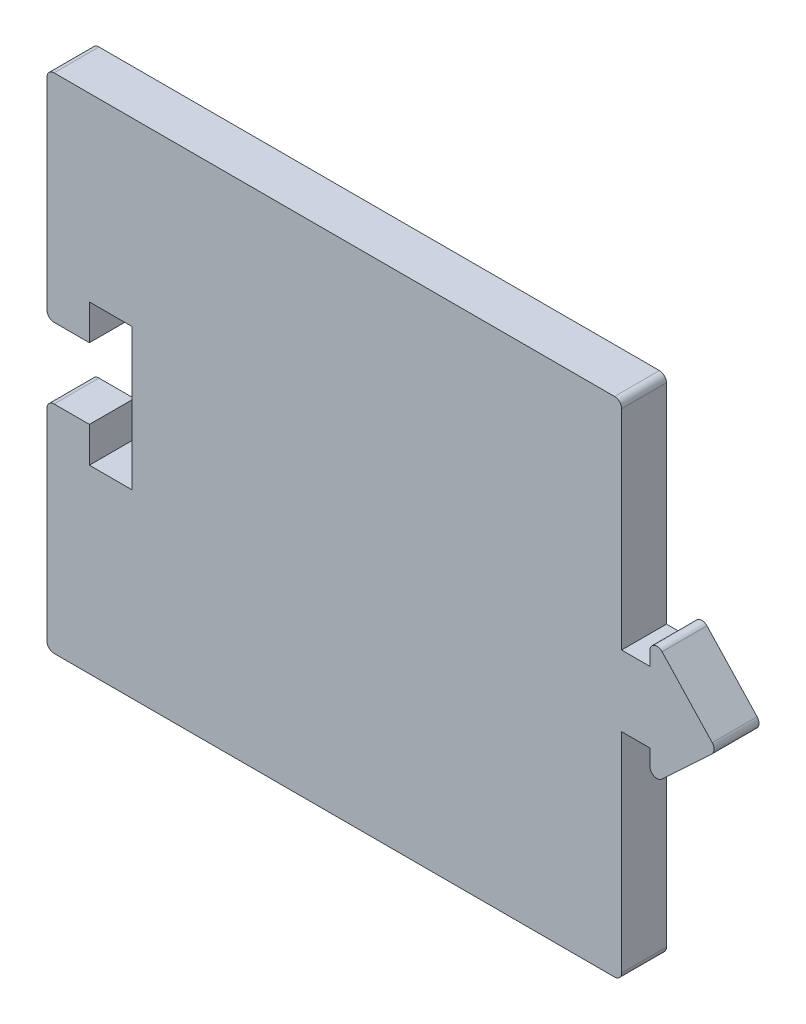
ISO-10303-21;
HEADER;
FILE_DESCRIPTION(('STEP AP214'),'2;1');
FILE_NAME('part.step','',(''),(''),'','','');
FILE_SCHEMA(('AUTOMOTIVE_DESIGN { 1 0 10303 214 1 1 1 1 }'));
ENDSEC;
DATA;
#1=APPLICATION_CONTEXT('core data for automotive mechanical design processes');
#2=APPLICATION_PROTOCOL_DEFINITION('international standard','automotive_design',2000,#1);
#3=PRODUCT_CONTEXT('',#1,'mechanical');
#4=PRODUCT('Part','Part','',(#3));
#5=PRODUCT_RELATED_PRODUCT_CATEGORY('part','',(#4));
#6=PRODUCT_DEFINITION_FORMATION('','',#4);
#7=PRODUCT_DEFINITION_CONTEXT('part definition',#1,'design');
#8=PRODUCT_DEFINITION('design','',#6,#7);
#9=PRODUCT_DEFINITION_SHAPE('','',#8);
#10=(LENGTH_UNIT() NAMED_UNIT(*) SI_UNIT(.MILLI.,.METRE.));
#11=(NAMED_UNIT(*) PLANE_ANGLE_UNIT() SI_UNIT($,.RADIAN.));
#12=(NAMED_UNIT(*) SI_UNIT($,.STERADIAN.) SOLID_ANGLE_UNIT());
#13=UNCERTAINTY_MEASURE_WITH_UNIT(LENGTH_MEASURE(1.E-05),#10,'distance_accuracy_value','');
#14=(GEOMETRIC_REPRESENTATION_CONTEXT(3) GLOBAL_UNCERTAINTY_ASSIGNED_CONTEXT((#13)) GLOBAL_UNIT_ASSIGNED_CONTEXT((#10,
#11,#12)) REPRESENTATION_CONTEXT('',''));
#15=CARTESIAN_POINT('',(0.,0.,0.));
#16=DIRECTION('',(0.,0.,1.));
#17=DIRECTION('',(1.,0.,0.));
#18=AXIS2_PLACEMENT_3D('',#15,#16,#17);
#19=CARTESIAN_POINT('',(0.,15.28,3.175));
#20=DIRECTION('',(1.,0.,0.));
#21=DIRECTION('',(0.,0.,-1.));
#22=AXIS2_PLACEMENT_3D('',#19,#20,#21);
#23=PLANE('',#22);
#24=DIRECTION('',(0.,-1.,0.));
#25=VECTOR('',#24,1.);
#26=CARTESIAN_POINT('',(0.,15.28,0.));
#27=LINE('',#26,#25);
#28=CARTESIAN_POINT('',(0.,14.78,0.));
#29=VERTEX_POINT('',#28);
#30=CARTESIAN_POINT('',(0.,0.5,0.));
#31=VERTEX_POINT('',#30);
#32=EDGE_CURVE('E284',#29,#31,#27,.T.);
#33=ORIENTED_EDGE('',*,*,#32,.T.);
#34=DIRECTION('',(0.,0.,-1.));
#35=VECTOR('',#34,1.);
#36=CARTESIAN_POINT('',(0.,0.5,3.175));
#37=LINE('',#36,#35);
#38=CARTESIAN_POINT('',(0.,0.5,3.175));
#39=VERTEX_POINT('',#38);
#40=EDGE_CURVE('E412',#31,#39,#37,.F.);
#41=ORIENTED_EDGE('',*,*,#40,.T.);
#42=DIRECTION('',(0.,-1.,0.));
#43=VECTOR('',#42,1.);
#44=CARTESIAN_POINT('',(0.,15.28,3.175));
#45=LINE('',#44,#43);
#46=CARTESIAN_POINT('',(0.,14.78,3.175));
#47=VERTEX_POINT('',#46);
#48=EDGE_CURVE('E329',#47,#39,#45,.T.);
#49=ORIENTED_EDGE('',*,*,#48,.F.);
#50=DIRECTION('',(0.,0.,-1.));
#51=VECTOR('',#50,1.);
#52=CARTESIAN_POINT('',(0.,14.78,3.175));
#53=LINE('',#52,#51);
#54=EDGE_CURVE('E409',#47,#29,#53,.T.);
#55=ORIENTED_EDGE('',*,*,#54,.T.);
#56=EDGE_LOOP('',(#33,#41,#49,#55));
#57=FACE_BOUND('',#56,.T.);
#58=ADVANCED_FACE('F33',(#57),#23,.F.);
#59=CARTESIAN_POINT('',(0.,0.,3.175));
#60=DIRECTION('',(0.,1.,0.));
#61=DIRECTION('',(-1.,0.,0.));
#62=AXIS2_PLACEMENT_3D('',#59,#60,#61);
#63=PLANE('',#62);
#64=DIRECTION('',(1.,0.,0.));
#65=VECTOR('',#64,1.);
#66=CARTESIAN_POINT('',(0.,0.,0.));
#67=LINE('',#66,#65);
#68=CARTESIAN_POINT('',(0.5,0.,0.));
#69=VERTEX_POINT('',#68);
#70=CARTESIAN_POINT('',(40.14,0.,0.));
#71=VERTEX_POINT('',#70);
#72=EDGE_CURVE('E287',#69,#71,#67,.T.);
#73=ORIENTED_EDGE('',*,*,#72,.T.);
#74=DIRECTION('',(0.,0.,-1.));
#75=VECTOR('',#74,1.);
#76=CARTESIAN_POINT('',(40.14,0.,3.175));
#77=LINE('',#76,#75);
#78=CARTESIAN_POINT('',(40.14,0.,3.175));
#79=VERTEX_POINT('',#78);
#80=EDGE_CURVE('E407',#71,#79,#77,.F.);
#81=ORIENTED_EDGE('',*,*,#80,.T.);
#82=DIRECTION('',(1.,0.,0.));
#83=VECTOR('',#82,1.);
#84=CARTESIAN_POINT('',(0.,0.,3.175));
#85=LINE('',#84,#83);
#86=CARTESIAN_POINT('',(0.5,0.,3.175));
#87=VERTEX_POINT('',#86);
#88=EDGE_CURVE('E231',#87,#79,#85,.T.);
#89=ORIENTED_EDGE('',*,*,#88,.F.);
#90=DIRECTION('',(0.,0.,-1.));
#91=VECTOR('',#90,1.);
#92=CARTESIAN_POINT('',(0.5,0.,3.175));
#93=LINE('',#92,#91);
#94=EDGE_CURVE('E404',#87,#69,#93,.T.);
#95=ORIENTED_EDGE('',*,*,#94,.T.);
#96=EDGE_LOOP('',(#73,#81,#89,#95));
#97=FACE_BOUND('',#96,.T.);
#98=ADVANCED_FACE('F494',(#97),#63,.F.);
#99=CARTESIAN_POINT('',(40.64,15.28,3.175));
#100=DIRECTION('',(-1.,0.,0.));
#101=DIRECTION('',(0.,0.,1.));
#102=AXIS2_PLACEMENT_3D('',#99,#100,#101);
#103=PLANE('',#102);
#104=DIRECTION('',(0.,1.,0.));
#105=VECTOR('',#104,1.);
#106=CARTESIAN_POINT('',(40.64,15.28,3.175));
#107=LINE('',#106,#105);
#108=CARTESIAN_POINT('',(40.64,0.499999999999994,3.175));
#109=VERTEX_POINT('',#108);
#110=CARTESIAN_POINT('',(40.64,15.28,3.175));
#111=VERTEX_POINT('',#110);
#112=EDGE_CURVE('E218',#109,#111,#107,.T.);
#113=ORIENTED_EDGE('',*,*,#112,.F.);
#114=DIRECTION('',(0.,0.,-1.));
#115=VECTOR('',#114,1.);
#116=CARTESIAN_POINT('',(40.64,0.499999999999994,3.175));
#117=LINE('',#116,#115);
#118=CARTESIAN_POINT('',(40.64,0.499999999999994,0.));
#119=VERTEX_POINT('',#118);
#120=EDGE_CURVE('E402',#109,#119,#117,.T.);
#121=ORIENTED_EDGE('',*,*,#120,.T.);
#122=DIRECTION('',(0.,1.,0.));
#123=VECTOR('',#122,1.);
#124=CARTESIAN_POINT('',(40.64,15.28,0.));
#125=LINE('',#124,#123);
#126=CARTESIAN_POINT('',(40.64,15.28,0.));
#127=VERTEX_POINT('',#126);
#128=EDGE_CURVE('E237',#119,#127,#125,.T.);
#129=ORIENTED_EDGE('',*,*,#128,.T.);
#130=DIRECTION('',(0.,0.,-1.));
#131=VECTOR('',#130,1.);
#132=CARTESIAN_POINT('',(40.64,15.28,3.175));
#133=LINE('',#132,#131);
#134=EDGE_CURVE('E234',#111,#127,#133,.T.);
#135=ORIENTED_EDGE('',*,*,#134,.F.);
#136=EDGE_LOOP('',(#113,#121,#129,#135));
#137=FACE_BOUND('',#136,.T.);
#138=ADVANCED_FACE('F235',(#137),#103,.F.);
#139=CARTESIAN_POINT('',(42.64,15.28,3.175));
#140=DIRECTION('',(0.,1.,0.));
#141=DIRECTION('',(0.,0.,1.));
#142=AXIS2_PLACEMENT_3D('',#139,#140,#141);
#143=PLANE('',#142);
#144=DIRECTION('',(1.,0.,0.));
#145=VECTOR('',#144,1.);
#146=CARTESIAN_POINT('',(42.64,15.28,0.));
#147=LINE('',#146,#145);
#148=CARTESIAN_POINT('',(42.64,15.28,0.));
#149=VERTEX_POINT('',#148);
#150=EDGE_CURVE('E291',#127,#149,#147,.T.);
#151=ORIENTED_EDGE('',*,*,#150,.T.);
#152=DIRECTION('',(0.,0.,-1.));
#153=VECTOR('',#152,1.);
#154=CARTESIAN_POINT('',(42.64,15.28,3.175));
#155=LINE('',#154,#153);
#156=CARTESIAN_POINT('',(42.64,15.28,3.175));
#157=VERTEX_POINT('',#156);
#158=EDGE_CURVE('E241',#157,#149,#155,.T.);
#159=ORIENTED_EDGE('',*,*,#158,.F.);
#160=DIRECTION('',(1.,0.,0.));
#161=VECTOR('',#160,1.);
#162=CARTESIAN_POINT('',(42.64,15.28,3.175));
#163=LINE('',#162,#161);
#164=EDGE_CURVE('E223',#111,#157,#163,.T.);
#165=ORIENTED_EDGE('',*,*,#164,.F.);
#166=ORIENTED_EDGE('',*,*,#134,.T.);
#167=EDGE_LOOP('',(#151,#159,#165,#166));
#168=FACE_BOUND('',#167,.T.);
#169=ADVANCED_FACE('F243',(#168),#143,.F.);
#170=CARTESIAN_POINT('',(42.64,13.0079287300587,3.175));
#171=DIRECTION('',(1.,0.,0.));
#172=DIRECTION('',(0.,1.,0.));
#173=AXIS2_PLACEMENT_3D('',#170,#171,#172);
#174=PLANE('',#173);
#175=DIRECTION('',(0.,-1.,0.));
#176=VECTOR('',#175,1.);
#177=CARTESIAN_POINT('',(42.64,13.0079287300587,0.));
#178=LINE('',#177,#176);
#179=CARTESIAN_POINT('',(42.64,14.1591981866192,0.));
#180=VERTEX_POINT('',#179);
#181=EDGE_CURVE('E293',#149,#180,#178,.T.);
#182=ORIENTED_EDGE('',*,*,#181,.T.);
#183=DIRECTION('',(0.,0.,-1.));
#184=VECTOR('',#183,1.);
#185=CARTESIAN_POINT('',(42.64,14.1591981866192,3.175));
#186=LINE('',#185,#184);
#187=CARTESIAN_POINT('',(42.64,14.1591981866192,3.175));
#188=VERTEX_POINT('',#187);
#189=EDGE_CURVE('E376',#180,#188,#186,.F.);
#190=ORIENTED_EDGE('',*,*,#189,.T.);
#191=DIRECTION('',(0.,-1.,0.));
#192=VECTOR('',#191,1.);
#193=CARTESIAN_POINT('',(42.64,13.0079287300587,3.175));
#194=LINE('',#193,#192);
#195=EDGE_CURVE('E246',#157,#188,#194,.T.);
#196=ORIENTED_EDGE('',*,*,#195,.F.);
#197=ORIENTED_EDGE('',*,*,#158,.T.);
#198=EDGE_LOOP('',(#182,#190,#196,#197));
#199=FACE_BOUND('',#198,.T.);
#200=ADVANCED_FACE('F501',(#199),#174,.F.);
#201=CARTESIAN_POINT('',(47.39,17.4449885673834,3.175));
#202=DIRECTION('',(-0.682624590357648,0.73076923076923,0.));
#203=DIRECTION('',(-0.73076923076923,-0.682624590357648,0.));
#204=AXIS2_PLACEMENT_3D('',#201,#202,#203);
#205=PLANE('',#204);
#206=DIRECTION('',(0.73076923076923,0.682624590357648,0.));
#207=VECTOR('',#206,1.);
#208=CARTESIAN_POINT('',(47.39,17.4449885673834,3.175));
#209=LINE('',#208,#207);
#210=CARTESIAN_POINT('',(43.4813122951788,13.7938135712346,3.175));
#211=VERTEX_POINT('',#210);
#212=CARTESIAN_POINT('',(47.0246153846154,17.1036762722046,3.175));
#213=VERTEX_POINT('',#212);
#214=EDGE_CURVE('E248',#211,#213,#209,.T.);
#215=ORIENTED_EDGE('',*,*,#214,.F.);
#216=DIRECTION('',(0.,0.,-1.));
#217=VECTOR('',#216,1.);
#218=CARTESIAN_POINT('',(43.4813122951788,13.7938135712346,3.175));
#219=LINE('',#218,#217);
#220=CARTESIAN_POINT('',(43.4813122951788,13.7938135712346,0.));
#221=VERTEX_POINT('',#220);
#222=EDGE_CURVE('E355',#211,#221,#219,.T.);
#223=ORIENTED_EDGE('',*,*,#222,.T.);
#224=DIRECTION('',(0.73076923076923,0.682624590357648,0.));
#225=VECTOR('',#224,1.);
#226=CARTESIAN_POINT('',(47.39,17.4449885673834,0.));
#227=LINE('',#226,#225);
#228=CARTESIAN_POINT('',(47.0246153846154,17.1036762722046,0.));
#229=VERTEX_POINT('',#228);
#230=EDGE_CURVE('E296',#221,#229,#227,.T.);
#231=ORIENTED_EDGE('',*,*,#230,.T.);
#232=DIRECTION('',(0.,0.,-1.));
#233=VECTOR('',#232,1.);
#234=CARTESIAN_POINT('',(47.0246153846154,17.1036762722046,3.175));
#235=LINE('',#234,#233);
#236=EDGE_CURVE('E240',#229,#213,#235,.F.);
#237=ORIENTED_EDGE('',*,*,#236,.T.);
#238=EDGE_LOOP('',(#215,#223,#231,#237));
#239=FACE_BOUND('',#238,.T.);
#240=ADVANCED_FACE('F509',(#239),#205,.F.);
#241=CARTESIAN_POINT('',(42.64,22.53,3.175));
#242=DIRECTION('',(-0.730769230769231,-0.682624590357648,0.));
#243=DIRECTION('',(0.682624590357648,-0.730769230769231,0.));
#244=AXIS2_PLACEMENT_3D('',#241,#242,#243);
#245=PLANE('',#244);
#246=DIRECTION('',(-0.682624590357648,0.730769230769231,0.));
#247=VECTOR('',#246,1.);
#248=CARTESIAN_POINT('',(42.64,22.53,3.175));
#249=LINE('',#248,#247);
#250=CARTESIAN_POINT('',(47.0486877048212,17.810373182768,3.175));
#251=VERTEX_POINT('',#250);
#252=CARTESIAN_POINT('',(43.5053846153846,21.603580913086,3.175));
#253=VERTEX_POINT('',#252);
#254=EDGE_CURVE('E254',#251,#253,#249,.T.);
#255=ORIENTED_EDGE('',*,*,#254,.F.);
#256=DIRECTION('',(0.,0.,-1.));
#257=VECTOR('',#256,1.);
#258=CARTESIAN_POINT('',(47.0486877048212,17.810373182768,3.175));
#259=LINE('',#258,#257);
#260=CARTESIAN_POINT('',(47.0486877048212,17.810373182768,0.));
#261=VERTEX_POINT('',#260);
#262=EDGE_CURVE('E396',#251,#261,#259,.T.);
#263=ORIENTED_EDGE('',*,*,#262,.T.);
#264=DIRECTION('',(-0.682624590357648,0.730769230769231,0.));
#265=VECTOR('',#264,1.);
#266=CARTESIAN_POINT('',(42.64,22.53,0.));
#267=LINE('',#266,#265);
#268=CARTESIAN_POINT('',(43.5053846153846,21.603580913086,0.));
#269=VERTEX_POINT('',#268);
#270=EDGE_CURVE('E299',#261,#269,#267,.T.);
#271=ORIENTED_EDGE('',*,*,#270,.T.);
#272=DIRECTION('',(0.,0.,-1.));
#273=VECTOR('',#272,1.);
#274=CARTESIAN_POINT('',(43.5053846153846,21.603580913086,3.175));
#275=LINE('',#274,#273);
#276=EDGE_CURVE('E394',#269,#253,#275,.F.);
#277=ORIENTED_EDGE('',*,*,#276,.T.);
#278=EDGE_LOOP('',(#255,#263,#271,#277));
#279=FACE_BOUND('',#278,.T.);
#280=ADVANCED_FACE('F518',(#279),#245,.F.);
#281=CARTESIAN_POINT('',(42.64,20.28,3.175));
#282=DIRECTION('',(1.,0.,0.));
#283=DIRECTION('',(0.,1.,0.));
#284=AXIS2_PLACEMENT_3D('',#281,#282,#283);
#285=PLANE('',#284);
#286=DIRECTION('',(0.,-1.,0.));
#287=VECTOR('',#286,1.);
#288=CARTESIAN_POINT('',(42.64,20.28,3.175));
#289=LINE('',#288,#287);
#290=CARTESIAN_POINT('',(42.64,21.2622686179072,3.175));
#291=VERTEX_POINT('',#290);
#292=CARTESIAN_POINT('',(42.64,20.28,3.175));
#293=VERTEX_POINT('',#292);
#294=EDGE_CURVE('E257',#291,#293,#289,.T.);
#295=ORIENTED_EDGE('',*,*,#294,.F.);
#296=DIRECTION('',(0.,0.,-1.));
#297=VECTOR('',#296,1.);
#298=CARTESIAN_POINT('',(42.64,21.2622686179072,3.175));
#299=LINE('',#298,#297);
#300=CARTESIAN_POINT('',(42.64,21.2622686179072,0.));
#301=VERTEX_POINT('',#300);
#302=EDGE_CURVE('E399',#291,#301,#299,.T.);
#303=ORIENTED_EDGE('',*,*,#302,.T.);
#304=DIRECTION('',(0.,-1.,0.));
#305=VECTOR('',#304,1.);
#306=CARTESIAN_POINT('',(42.64,20.28,0.));
#307=LINE('',#306,#305);
#308=CARTESIAN_POINT('',(42.64,20.28,0.));
#309=VERTEX_POINT('',#308);
#310=EDGE_CURVE('E302',#301,#309,#307,.T.);
#311=ORIENTED_EDGE('',*,*,#310,.T.);
#312=DIRECTION('',(0.,0.,-1.));
#313=VECTOR('',#312,1.);
#314=CARTESIAN_POINT('',(42.64,20.28,3.175));
#315=LINE('',#314,#313);
#316=EDGE_CURVE('E350',#293,#309,#315,.T.);
#317=ORIENTED_EDGE('',*,*,#316,.F.);
#318=EDGE_LOOP('',(#295,#303,#311,#317));
#319=FACE_BOUND('',#318,.T.);
#320=ADVANCED_FACE('F527',(#319),#285,.F.);
#321=CARTESIAN_POINT('',(40.64,20.28,3.175));
#322=DIRECTION('',(0.,-1.,0.));
#323=DIRECTION('',(0.,0.,-1.));
#324=AXIS2_PLACEMENT_3D('',#321,#322,#323);
#325=PLANE('',#324);
#326=DIRECTION('',(-1.,0.,0.));
#327=VECTOR('',#326,1.);
#328=CARTESIAN_POINT('',(40.64,20.28,0.));
#329=LINE('',#328,#327);
#330=CARTESIAN_POINT('',(40.64,20.28,0.));
#331=VERTEX_POINT('',#330);
#332=EDGE_CURVE('E304',#309,#331,#329,.T.);
#333=ORIENTED_EDGE('',*,*,#332,.T.);
#334=DIRECTION('',(0.,0.,-1.));
#335=VECTOR('',#334,1.);
#336=CARTESIAN_POINT('',(40.64,20.28,3.175));
#337=LINE('',#336,#335);
#338=CARTESIAN_POINT('',(40.64,20.28,3.175));
#339=VERTEX_POINT('',#338);
#340=EDGE_CURVE('E347',#339,#331,#337,.T.);
#341=ORIENTED_EDGE('',*,*,#340,.F.);
#342=DIRECTION('',(-1.,0.,0.));
#343=VECTOR('',#342,1.);
#344=CARTESIAN_POINT('',(40.64,20.28,3.175));
#345=LINE('',#344,#343);
#346=EDGE_CURVE('E259',#293,#339,#345,.T.);
#347=ORIENTED_EDGE('',*,*,#346,.F.);
#348=ORIENTED_EDGE('',*,*,#316,.T.);
#349=EDGE_LOOP('',(#333,#341,#347,#348));
#350=FACE_BOUND('',#349,.T.);
#351=ADVANCED_FACE('F532',(#350),#325,.F.);
#352=CARTESIAN_POINT('',(40.64,35.56,3.175));
#353=DIRECTION('',(-1.,0.,0.));
#354=DIRECTION('',(0.,-1.,0.));
#355=AXIS2_PLACEMENT_3D('',#352,#353,#354);
#356=PLANE('',#355);
#357=DIRECTION('',(0.,1.,0.));
#358=VECTOR('',#357,1.);
#359=CARTESIAN_POINT('',(40.64,35.56,0.));
#360=LINE('',#359,#358);
#361=CARTESIAN_POINT('',(40.64,35.06,0.));
#362=VERTEX_POINT('',#361);
#363=EDGE_CURVE('E306',#331,#362,#360,.T.);
#364=ORIENTED_EDGE('',*,*,#363,.T.);
#365=DIRECTION('',(0.,0.,-1.));
#366=VECTOR('',#365,1.);
#367=CARTESIAN_POINT('',(40.64,35.06,3.175));
#368=LINE('',#367,#366);
#369=CARTESIAN_POINT('',(40.64,35.06,3.175));
#370=VERTEX_POINT('',#369);
#371=EDGE_CURVE('E11',#362,#370,#368,.F.);
#372=ORIENTED_EDGE('',*,*,#371,.T.);
#373=DIRECTION('',(0.,1.,0.));
#374=VECTOR('',#373,1.);
#375=CARTESIAN_POINT('',(40.64,35.56,3.175));
#376=LINE('',#375,#374);
#377=EDGE_CURVE('E261',#339,#370,#376,.T.);
#378=ORIENTED_EDGE('',*,*,#377,.F.);
#379=ORIENTED_EDGE('',*,*,#340,.T.);
#380=EDGE_LOOP('',(#364,#372,#378,#379));
#381=FACE_BOUND('',#380,.T.);
#382=ADVANCED_FACE('F536',(#381),#356,.F.);
#383=CARTESIAN_POINT('',(0.,35.56,3.175));
#384=DIRECTION('',(0.,-1.,0.));
#385=DIRECTION('',(1.,0.,0.));
#386=AXIS2_PLACEMENT_3D('',#383,#384,#385);
#387=PLANE('',#386);
#388=DIRECTION('',(-1.,0.,0.));
#389=VECTOR('',#388,1.);
#390=CARTESIAN_POINT('',(0.,35.56,3.175));
#391=LINE('',#390,#389);
#392=CARTESIAN_POINT('',(40.14,35.56,3.175));
#393=VERTEX_POINT('',#392);
#394=CARTESIAN_POINT('',(0.5,35.56,3.175));
#395=VERTEX_POINT('',#394);
#396=EDGE_CURVE('E264',#393,#395,#391,.T.);
#397=ORIENTED_EDGE('',*,*,#396,.F.);
#398=DIRECTION('',(0.,0.,-1.));
#399=VECTOR('',#398,1.);
#400=CARTESIAN_POINT('',(40.14,35.56,3.175));
#401=LINE('',#400,#399);
#402=CARTESIAN_POINT('',(40.14,35.56,0.));
#403=VERTEX_POINT('',#402);
#404=EDGE_CURVE('E41',#393,#403,#401,.T.);
#405=ORIENTED_EDGE('',*,*,#404,.T.);
#406=DIRECTION('',(-1.,0.,0.));
#407=VECTOR('',#406,1.);
#408=CARTESIAN_POINT('',(0.,35.56,0.));
#409=LINE('',#408,#407);
#410=CARTESIAN_POINT('',(0.5,35.56,0.));
#411=VERTEX_POINT('',#410);
#412=EDGE_CURVE('E309',#403,#411,#409,.T.);
#413=ORIENTED_EDGE('',*,*,#412,.T.);
#414=DIRECTION('',(0.,0.,-1.));
#415=VECTOR('',#414,1.);
#416=CARTESIAN_POINT('',(0.5,35.56,3.175));
#417=LINE('',#416,#415);
#418=EDGE_CURVE('E423',#411,#395,#417,.F.);
#419=ORIENTED_EDGE('',*,*,#418,.T.);
#420=EDGE_LOOP('',(#397,#405,#413,#419));
#421=FACE_BOUND('',#420,.T.);
#422=ADVANCED_FACE('F429',(#421),#387,.F.);
#423=CARTESIAN_POINT('',(0.,35.56,3.175));
#424=DIRECTION('',(1.,0.,0.));
#425=DIRECTION('',(0.,0.,-1.));
#426=AXIS2_PLACEMENT_3D('',#423,#424,#425);
#427=PLANE('',#426);
#428=DIRECTION('',(0.,-1.,0.));
#429=VECTOR('',#428,1.);
#430=CARTESIAN_POINT('',(0.,35.56,0.));
#431=LINE('',#430,#429);
#432=CARTESIAN_POINT('',(0.,35.06,0.));
#433=VERTEX_POINT('',#432);
#434=CARTESIAN_POINT('',(0.,20.78,0.));
#435=VERTEX_POINT('',#434);
#436=EDGE_CURVE('E312',#433,#435,#431,.T.);
#437=ORIENTED_EDGE('',*,*,#436,.T.);
#438=DIRECTION('',(0.,0.,-1.));
#439=VECTOR('',#438,1.);
#440=CARTESIAN_POINT('',(0.,20.78,3.175));
#441=LINE('',#440,#439);
#442=CARTESIAN_POINT('',(0.,20.78,3.175));
#443=VERTEX_POINT('',#442);
#444=EDGE_CURVE('E421',#435,#443,#441,.F.);
#445=ORIENTED_EDGE('',*,*,#444,.T.);
#446=DIRECTION('',(0.,-1.,0.));
#447=VECTOR('',#446,1.);
#448=CARTESIAN_POINT('',(0.,35.56,3.175));
#449=LINE('',#448,#447);
#450=CARTESIAN_POINT('',(0.,35.06,3.175));
#451=VERTEX_POINT('',#450);
#452=EDGE_CURVE('E267',#451,#443,#449,.T.);
#453=ORIENTED_EDGE('',*,*,#452,.F.);
#454=DIRECTION('',(0.,0.,-1.));
#455=VECTOR('',#454,1.);
#456=CARTESIAN_POINT('',(0.,35.06,3.175));
#457=LINE('',#456,#455);
#458=EDGE_CURVE('E418',#451,#433,#457,.T.);
#459=ORIENTED_EDGE('',*,*,#458,.T.);
#460=EDGE_LOOP('',(#437,#445,#453,#459));
#461=FACE_BOUND('',#460,.T.);
#462=ADVANCED_FACE('F443',(#461),#427,.F.);
#463=CARTESIAN_POINT('',(0.,20.28,3.175));
#464=DIRECTION('',(0.,1.,0.));
#465=DIRECTION('',(-1.,0.,0.));
#466=AXIS2_PLACEMENT_3D('',#463,#464,#465);
#467=PLANE('',#466);
#468=DIRECTION('',(1.,0.,0.));
#469=VECTOR('',#468,1.);
#470=CARTESIAN_POINT('',(0.,20.28,3.175));
#471=LINE('',#470,#469);
#472=CARTESIAN_POINT('',(0.500000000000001,20.28,3.175));
#473=VERTEX_POINT('',#472);
#474=CARTESIAN_POINT('',(3.,20.28,3.175));
#475=VERTEX_POINT('',#474);
#476=EDGE_CURVE('E269',#473,#475,#471,.T.);
#477=ORIENTED_EDGE('',*,*,#476,.F.);
#478=DIRECTION('',(0.,0.,-1.));
#479=VECTOR('',#478,1.);
#480=CARTESIAN_POINT('',(0.500000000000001,20.28,3.175));
#481=LINE('',#480,#479);
#482=CARTESIAN_POINT('',(0.500000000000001,20.28,0.));
#483=VERTEX_POINT('',#482);
#484=EDGE_CURVE('E415',#473,#483,#481,.T.);
#485=ORIENTED_EDGE('',*,*,#484,.T.);
#486=DIRECTION('',(1.,0.,0.));
#487=VECTOR('',#486,1.);
#488=CARTESIAN_POINT('',(0.,20.28,0.));
#489=LINE('',#488,#487);
#490=CARTESIAN_POINT('',(3.,20.28,0.));
#491=VERTEX_POINT('',#490);
#492=EDGE_CURVE('E315',#483,#491,#489,.T.);
#493=ORIENTED_EDGE('',*,*,#492,.T.);
#494=DIRECTION('',(0.,0.,-1.));
#495=VECTOR('',#494,1.);
#496=CARTESIAN_POINT('',(3.,20.28,3.175));
#497=LINE('',#496,#495);
#498=EDGE_CURVE('E344',#475,#491,#497,.T.);
#499=ORIENTED_EDGE('',*,*,#498,.F.);
#500=EDGE_LOOP('',(#477,#485,#493,#499));
#501=FACE_BOUND('',#500,.T.);
#502=ADVANCED_FACE('F450',(#501),#467,.F.);
#503=CARTESIAN_POINT('',(3.,20.28,3.175));
#504=DIRECTION('',(-1.,0.,0.));
#505=DIRECTION('',(0.,0.,1.));
#506=AXIS2_PLACEMENT_3D('',#503,#504,#505);
#507=PLANE('',#506);
#508=DIRECTION('',(0.,1.,0.));
#509=VECTOR('',#508,1.);
#510=CARTESIAN_POINT('',(3.,20.28,0.));
#511=LINE('',#510,#509);
#512=CARTESIAN_POINT('',(3.,22.78,0.));
#513=VERTEX_POINT('',#512);
#514=EDGE_CURVE('E317',#491,#513,#511,.T.);
#515=ORIENTED_EDGE('',*,*,#514,.T.);
#516=DIRECTION('',(0.,0.,-1.));
#517=VECTOR('',#516,1.);
#518=CARTESIAN_POINT('',(3.,22.78,3.175));
#519=LINE('',#518,#517);
#520=CARTESIAN_POINT('',(3.,22.78,3.175));
#521=VERTEX_POINT('',#520);
#522=EDGE_CURVE('E341',#521,#513,#519,.T.);
#523=ORIENTED_EDGE('',*,*,#522,.F.);
#524=DIRECTION('',(0.,1.,0.));
#525=VECTOR('',#524,1.);
#526=CARTESIAN_POINT('',(3.,20.28,3.175));
#527=LINE('',#526,#525);
#528=EDGE_CURVE('E271',#475,#521,#527,.T.);
#529=ORIENTED_EDGE('',*,*,#528,.F.);
#530=ORIENTED_EDGE('',*,*,#498,.T.);
#531=EDGE_LOOP('',(#515,#523,#529,#530));
#532=FACE_BOUND('',#531,.T.);
#533=ADVANCED_FACE('F457',(#532),#507,.F.);
#534=CARTESIAN_POINT('',(3.,22.78,3.175));
#535=DIRECTION('',(0.,1.,0.));
#536=DIRECTION('',(0.,0.,1.));
#537=AXIS2_PLACEMENT_3D('',#534,#535,#536);
#538=PLANE('',#537);
#539=DIRECTION('',(1.,0.,0.));
#540=VECTOR('',#539,1.);
#541=CARTESIAN_POINT('',(3.,22.78,0.));
#542=LINE('',#541,#540);
#543=CARTESIAN_POINT('',(6.,22.78,0.));
#544=VERTEX_POINT('',#543);
#545=EDGE_CURVE('E319',#513,#544,#542,.T.);
#546=ORIENTED_EDGE('',*,*,#545,.T.);
#547=DIRECTION('',(0.,0.,-1.));
#548=VECTOR('',#547,1.);
#549=CARTESIAN_POINT('',(6.,22.78,3.175));
#550=LINE('',#549,#548);
#551=CARTESIAN_POINT('',(6.,22.78,3.175));
#552=VERTEX_POINT('',#551);
#553=EDGE_CURVE('E338',#552,#544,#550,.T.);
#554=ORIENTED_EDGE('',*,*,#553,.F.);
#555=DIRECTION('',(1.,0.,0.));
#556=VECTOR('',#555,1.);
#557=CARTESIAN_POINT('',(3.,22.78,3.175));
#558=LINE('',#557,#556);
#559=EDGE_CURVE('E273',#521,#552,#558,.T.);
#560=ORIENTED_EDGE('',*,*,#559,.F.);
#561=ORIENTED_EDGE('',*,*,#522,.T.);
#562=EDGE_LOOP('',(#546,#554,#560,#561));
#563=FACE_BOUND('',#562,.T.);
#564=ADVANCED_FACE('F461',(#563),#538,.F.);
#565=CARTESIAN_POINT('',(6.,22.78,3.175));
#566=DIRECTION('',(1.,0.,0.));
#567=DIRECTION('',(0.,1.,0.));
#568=AXIS2_PLACEMENT_3D('',#565,#566,#567);
#569=PLANE('',#568);
#570=DIRECTION('',(0.,-1.,0.));
#571=VECTOR('',#570,1.);
#572=CARTESIAN_POINT('',(6.,22.78,0.));
#573=LINE('',#572,#571);
#574=CARTESIAN_POINT('',(6.,12.78,0.));
#575=VERTEX_POINT('',#574);
#576=EDGE_CURVE('E321',#544,#575,#573,.T.);
#577=ORIENTED_EDGE('',*,*,#576,.T.);
#578=DIRECTION('',(0.,0.,-1.));
#579=VECTOR('',#578,1.);
#580=CARTESIAN_POINT('',(6.,12.78,3.175));
#581=LINE('',#580,#579);
#582=CARTESIAN_POINT('',(6.,12.78,3.175));
#583=VERTEX_POINT('',#582);
#584=EDGE_CURVE('E335',#583,#575,#581,.T.);
#585=ORIENTED_EDGE('',*,*,#584,.F.);
#586=DIRECTION('',(0.,-1.,0.));
#587=VECTOR('',#586,1.);
#588=CARTESIAN_POINT('',(6.,22.78,3.175));
#589=LINE('',#588,#587);
#590=EDGE_CURVE('E275',#552,#583,#589,.T.);
#591=ORIENTED_EDGE('',*,*,#590,.F.);
#592=ORIENTED_EDGE('',*,*,#553,.T.);
#593=EDGE_LOOP('',(#577,#585,#591,#592));
#594=FACE_BOUND('',#593,.T.);
#595=ADVANCED_FACE('F468',(#594),#569,.F.);
#596=CARTESIAN_POINT('',(6.,12.78,3.175));
#597=DIRECTION('',(0.,-1.,0.));
#598=DIRECTION('',(0.,0.,-1.));
#599=AXIS2_PLACEMENT_3D('',#596,#597,#598);
#600=PLANE('',#599);
#601=DIRECTION('',(-1.,0.,0.));
#602=VECTOR('',#601,1.);
#603=CARTESIAN_POINT('',(6.,12.78,0.));
#604=LINE('',#603,#602);
#605=CARTESIAN_POINT('',(3.,12.78,0.));
#606=VERTEX_POINT('',#605);
#607=EDGE_CURVE('E323',#575,#606,#604,.T.);
#608=ORIENTED_EDGE('',*,*,#607,.T.);
#609=DIRECTION('',(0.,0.,-1.));
#610=VECTOR('',#609,1.);
#611=CARTESIAN_POINT('',(3.,12.78,3.175));
#612=LINE('',#611,#610);
#613=CARTESIAN_POINT('',(3.,12.78,3.175));
#614=VERTEX_POINT('',#613);
#615=EDGE_CURVE('E332',#614,#606,#612,.T.);
#616=ORIENTED_EDGE('',*,*,#615,.F.);
#617=DIRECTION('',(-1.,0.,0.));
#618=VECTOR('',#617,1.);
#619=CARTESIAN_POINT('',(6.,12.78,3.175));
#620=LINE('',#619,#618);
#621=EDGE_CURVE('E277',#583,#614,#620,.T.);
#622=ORIENTED_EDGE('',*,*,#621,.F.);
#623=ORIENTED_EDGE('',*,*,#584,.T.);
#624=EDGE_LOOP('',(#608,#616,#622,#623));
#625=FACE_BOUND('',#624,.T.);
#626=ADVANCED_FACE('F471',(#625),#600,.F.);
#627=CARTESIAN_POINT('',(3.,12.78,3.175));
#628=DIRECTION('',(-1.,0.,0.));
#629=DIRECTION('',(0.,0.,1.));
#630=AXIS2_PLACEMENT_3D('',#627,#628,#629);
#631=PLANE('',#630);
#632=DIRECTION('',(0.,1.,0.));
#633=VECTOR('',#632,1.);
#634=CARTESIAN_POINT('',(3.,12.78,0.));
#635=LINE('',#634,#633);
#636=CARTESIAN_POINT('',(3.,15.28,0.));
#637=VERTEX_POINT('',#636);
#638=EDGE_CURVE('E325',#606,#637,#635,.T.);
#639=ORIENTED_EDGE('',*,*,#638,.T.);
#640=DIRECTION('',(0.,0.,-1.));
#641=VECTOR('',#640,1.);
#642=CARTESIAN_POINT('',(3.,15.28,3.175));
#643=LINE('',#642,#641);
#644=CARTESIAN_POINT('',(3.,15.28,3.175));
#645=VERTEX_POINT('',#644);
#646=EDGE_CURVE('E283',#645,#637,#643,.T.);
#647=ORIENTED_EDGE('',*,*,#646,.F.);
#648=DIRECTION('',(0.,1.,0.));
#649=VECTOR('',#648,1.);
#650=CARTESIAN_POINT('',(3.,12.78,3.175));
#651=LINE('',#650,#649);
#652=EDGE_CURVE('E279',#614,#645,#651,.T.);
#653=ORIENTED_EDGE('',*,*,#652,.F.);
#654=ORIENTED_EDGE('',*,*,#615,.T.);
#655=EDGE_LOOP('',(#639,#647,#653,#654));
#656=FACE_BOUND('',#655,.T.);
#657=ADVANCED_FACE('F476',(#656),#631,.F.);
#658=CARTESIAN_POINT('',(0.,15.28,3.175));
#659=DIRECTION('',(0.,-1.,0.));
#660=DIRECTION('',(1.,0.,0.));
#661=AXIS2_PLACEMENT_3D('',#658,#659,#660);
#662=PLANE('',#661);
#663=DIRECTION('',(-1.,0.,0.));
#664=VECTOR('',#663,1.);
#665=CARTESIAN_POINT('',(0.,15.28,0.));
#666=LINE('',#665,#664);
#667=CARTESIAN_POINT('',(0.500000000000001,15.28,0.));
#668=VERTEX_POINT('',#667);
#669=EDGE_CURVE('E327',#637,#668,#666,.T.);
#670=ORIENTED_EDGE('',*,*,#669,.T.);
#671=DIRECTION('',(0.,0.,-1.));
#672=VECTOR('',#671,1.);
#673=CARTESIAN_POINT('',(0.500000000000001,15.28,3.175));
#674=LINE('',#673,#672);
#675=CARTESIAN_POINT('',(0.500000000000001,15.28,3.175));
#676=VERTEX_POINT('',#675);
#677=EDGE_CURVE('E48',#668,#676,#674,.F.);
#678=ORIENTED_EDGE('',*,*,#677,.T.);
#679=DIRECTION('',(-1.,0.,0.));
#680=VECTOR('',#679,1.);
#681=CARTESIAN_POINT('',(0.,15.28,3.175));
#682=LINE('',#681,#680);
#683=EDGE_CURVE('E281',#645,#676,#682,.T.);
#684=ORIENTED_EDGE('',*,*,#683,.F.);
#685=ORIENTED_EDGE('',*,*,#646,.T.);
#686=EDGE_LOOP('',(#670,#678,#684,#685));
#687=FACE_BOUND('',#686,.T.);
#688=ADVANCED_FACE('F625',(#687),#662,.F.);
#689=CARTESIAN_POINT('',(0.,0.,3.175));
#690=DIRECTION('',(0.,0.,1.));
#691=DIRECTION('',(1.,0.,0.));
#692=AXIS2_PLACEMENT_3D('',#689,#690,#691);
#693=PLANE('',#692);
#694=ORIENTED_EDGE('',*,*,#195,.T.);
#695=CARTESIAN_POINT('',(43.14,14.1591981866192,3.175));
#696=DIRECTION('',(0.,0.,1.));
#697=DIRECTION('',(1.,0.,0.));
#698=AXIS2_PLACEMENT_3D('',#695,#696,#697);
#699=CIRCLE('',#698,0.5);
#700=EDGE_CURVE('E392',#188,#211,#699,.T.);
#701=ORIENTED_EDGE('',*,*,#700,.T.);
#702=ORIENTED_EDGE('',*,*,#214,.T.);
#703=CARTESIAN_POINT('',(46.6833030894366,17.4690608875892,3.175));
#704=DIRECTION('',(0.,0.,1.));
#705=DIRECTION('',(1.,0.,0.));
#706=AXIS2_PLACEMENT_3D('',#703,#704,#705);
#707=CIRCLE('',#706,0.5);
#708=EDGE_CURVE('E390',#213,#251,#707,.T.);
#709=ORIENTED_EDGE('',*,*,#708,.T.);
#710=ORIENTED_EDGE('',*,*,#254,.T.);
#711=CARTESIAN_POINT('',(43.14,21.2622686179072,3.175));
#712=DIRECTION('',(0.,0.,1.));
#713=DIRECTION('',(1.,0.,0.));
#714=AXIS2_PLACEMENT_3D('',#711,#712,#713);
#715=CIRCLE('',#714,0.5);
#716=EDGE_CURVE('E388',#253,#291,#715,.T.);
#717=ORIENTED_EDGE('',*,*,#716,.T.);
#718=ORIENTED_EDGE('',*,*,#294,.T.);
#719=ORIENTED_EDGE('',*,*,#346,.T.);
#720=ORIENTED_EDGE('',*,*,#377,.T.);
#721=CARTESIAN_POINT('',(40.14,35.06,3.175));
#722=DIRECTION('',(0.,0.,1.));
#723=DIRECTION('',(1.,0.,0.));
#724=AXIS2_PLACEMENT_3D('',#721,#722,#723);
#725=CIRCLE('',#724,0.5);
#726=EDGE_CURVE('E380',#370,#393,#725,.T.);
#727=ORIENTED_EDGE('',*,*,#726,.T.);
#728=ORIENTED_EDGE('',*,*,#396,.T.);
#729=CARTESIAN_POINT('',(0.5,35.06,3.175));
#730=DIRECTION('',(0.,0.,1.));
#731=DIRECTION('',(1.,0.,0.));
#732=AXIS2_PLACEMENT_3D('',#729,#730,#731);
#733=CIRCLE('',#732,0.5);
#734=EDGE_CURVE('E378',#395,#451,#733,.T.);
#735=ORIENTED_EDGE('',*,*,#734,.T.);
#736=ORIENTED_EDGE('',*,*,#452,.T.);
#737=CARTESIAN_POINT('',(0.5,20.78,3.175));
#738=DIRECTION('',(0.,0.,1.));
#739=DIRECTION('',(1.,0.,0.));
#740=AXIS2_PLACEMENT_3D('',#737,#738,#739);
#741=CIRCLE('',#740,0.5);
#742=EDGE_CURVE('E56',#443,#473,#741,.T.);
#743=ORIENTED_EDGE('',*,*,#742,.T.);
#744=ORIENTED_EDGE('',*,*,#476,.T.);
#745=ORIENTED_EDGE('',*,*,#528,.T.);
#746=ORIENTED_EDGE('',*,*,#559,.T.);
#747=ORIENTED_EDGE('',*,*,#590,.T.);
#748=ORIENTED_EDGE('',*,*,#621,.T.);
#749=ORIENTED_EDGE('',*,*,#652,.T.);
#750=ORIENTED_EDGE('',*,*,#683,.T.);
#751=CARTESIAN_POINT('',(0.5,14.78,3.175));
#752=DIRECTION('',(0.,0.,1.));
#753=DIRECTION('',(1.,0.,0.));
#754=AXIS2_PLACEMENT_3D('',#751,#752,#753);
#755=CIRCLE('',#754,0.5);
#756=EDGE_CURVE('E383',#676,#47,#755,.T.);
#757=ORIENTED_EDGE('',*,*,#756,.T.);
#758=ORIENTED_EDGE('',*,*,#48,.T.);
#759=CARTESIAN_POINT('',(0.5,0.5,3.175));
#760=DIRECTION('',(0.,0.,1.));
#761=DIRECTION('',(1.,0.,0.));
#762=AXIS2_PLACEMENT_3D('',#759,#760,#761);
#763=CIRCLE('',#762,0.5);
#764=EDGE_CURVE('E385',#39,#87,#763,.T.);
#765=ORIENTED_EDGE('',*,*,#764,.T.);
#766=ORIENTED_EDGE('',*,*,#88,.T.);
#767=CARTESIAN_POINT('',(40.14,0.499999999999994,3.175));
#768=DIRECTION('',(0.,0.,1.));
#769=DIRECTION('',(1.,0.,0.));
#770=AXIS2_PLACEMENT_3D('',#767,#768,#769);
#771=CIRCLE('',#770,0.5);
#772=EDGE_CURVE('E227',#79,#109,#771,.T.);
#773=ORIENTED_EDGE('',*,*,#772,.T.);
#774=ORIENTED_EDGE('',*,*,#112,.T.);
#775=ORIENTED_EDGE('',*,*,#164,.T.);
#776=EDGE_LOOP('',(#694,#701,#702,#709,#710,#717,#718,#719,#720,#727,#728,#735,#736,#743,#744,
#745,#746,#747,#748,#749,#750,#757,#758,#765,#766,#773,#774,#775));
#777=FACE_BOUND('',#776,.T.);
#778=ADVANCED_FACE('F221',(#777),#693,.T.);
#779=CARTESIAN_POINT('',(0.,0.,0.));
#780=DIRECTION('',(0.,0.,1.));
#781=DIRECTION('',(1.,0.,0.));
#782=AXIS2_PLACEMENT_3D('',#779,#780,#781);
#783=PLANE('',#782);
#784=ORIENTED_EDGE('',*,*,#230,.F.);
#785=CARTESIAN_POINT('',(43.14,14.1591981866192,0.));
#786=DIRECTION('',(0.,0.,1.));
#787=DIRECTION('',(1.,0.,0.));
#788=AXIS2_PLACEMENT_3D('',#785,#786,#787);
#789=CIRCLE('',#788,0.5);
#790=EDGE_CURVE('E374',#221,#180,#789,.F.);
#791=ORIENTED_EDGE('',*,*,#790,.T.);
#792=ORIENTED_EDGE('',*,*,#181,.F.);
#793=ORIENTED_EDGE('',*,*,#150,.F.);
#794=ORIENTED_EDGE('',*,*,#128,.F.);
#795=CARTESIAN_POINT('',(40.14,0.499999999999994,0.));
#796=DIRECTION('',(0.,0.,1.));
#797=DIRECTION('',(1.,0.,0.));
#798=AXIS2_PLACEMENT_3D('',#795,#796,#797);
#799=CIRCLE('',#798,0.5);
#800=EDGE_CURVE('E368',#119,#71,#799,.F.);
#801=ORIENTED_EDGE('',*,*,#800,.T.);
#802=ORIENTED_EDGE('',*,*,#72,.F.);
#803=CARTESIAN_POINT('',(0.5,0.5,0.));
#804=DIRECTION('',(0.,0.,1.));
#805=DIRECTION('',(1.,0.,0.));
#806=AXIS2_PLACEMENT_3D('',#803,#804,#805);
#807=CIRCLE('',#806,0.5);
#808=EDGE_CURVE('E366',#69,#31,#807,.F.);
#809=ORIENTED_EDGE('',*,*,#808,.T.);
#810=ORIENTED_EDGE('',*,*,#32,.F.);
#811=CARTESIAN_POINT('',(0.5,14.78,0.));
#812=DIRECTION('',(0.,0.,1.));
#813=DIRECTION('',(1.,0.,0.));
#814=AXIS2_PLACEMENT_3D('',#811,#812,#813);
#815=CIRCLE('',#814,0.5);
#816=EDGE_CURVE('E364',#29,#668,#815,.F.);
#817=ORIENTED_EDGE('',*,*,#816,.T.);
#818=ORIENTED_EDGE('',*,*,#669,.F.);
#819=ORIENTED_EDGE('',*,*,#638,.F.);
#820=ORIENTED_EDGE('',*,*,#607,.F.);
#821=ORIENTED_EDGE('',*,*,#576,.F.);
#822=ORIENTED_EDGE('',*,*,#545,.F.);
#823=ORIENTED_EDGE('',*,*,#514,.F.);
#824=ORIENTED_EDGE('',*,*,#492,.F.);
#825=CARTESIAN_POINT('',(0.5,20.78,0.));
#826=DIRECTION('',(0.,0.,1.));
#827=DIRECTION('',(1.,0.,0.));
#828=AXIS2_PLACEMENT_3D('',#825,#826,#827);
#829=CIRCLE('',#828,0.5);
#830=EDGE_CURVE('E362',#483,#435,#829,.F.);
#831=ORIENTED_EDGE('',*,*,#830,.T.);
#832=ORIENTED_EDGE('',*,*,#436,.F.);
#833=CARTESIAN_POINT('',(0.5,35.06,0.));
#834=DIRECTION('',(0.,0.,1.));
#835=DIRECTION('',(1.,0.,0.));
#836=AXIS2_PLACEMENT_3D('',#833,#834,#835);
#837=CIRCLE('',#836,0.5);
#838=EDGE_CURVE('E358',#433,#411,#837,.F.);
#839=ORIENTED_EDGE('',*,*,#838,.T.);
#840=ORIENTED_EDGE('',*,*,#412,.F.);
#841=CARTESIAN_POINT('',(40.14,35.06,0.));
#842=DIRECTION('',(0.,0.,1.));
#843=DIRECTION('',(1.,0.,0.));
#844=AXIS2_PLACEMENT_3D('',#841,#842,#843);
#845=CIRCLE('',#844,0.5);
#846=EDGE_CURVE('E360',#403,#362,#845,.F.);
#847=ORIENTED_EDGE('',*,*,#846,.T.);
#848=ORIENTED_EDGE('',*,*,#363,.F.);
#849=ORIENTED_EDGE('',*,*,#332,.F.);
#850=ORIENTED_EDGE('',*,*,#310,.F.);
#851=CARTESIAN_POINT('',(43.14,21.2622686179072,0.));
#852=DIRECTION('',(0.,0.,1.));
#853=DIRECTION('',(1.,0.,0.));
#854=AXIS2_PLACEMENT_3D('',#851,#852,#853);
#855=CIRCLE('',#854,0.5);
#856=EDGE_CURVE('E370',#301,#269,#855,.F.);
#857=ORIENTED_EDGE('',*,*,#856,.T.);
#858=ORIENTED_EDGE('',*,*,#270,.F.);
#859=CARTESIAN_POINT('',(46.6833030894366,17.4690608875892,0.));
#860=DIRECTION('',(0.,0.,1.));
#861=DIRECTION('',(1.,0.,0.));
#862=AXIS2_PLACEMENT_3D('',#859,#860,#861);
#863=CIRCLE('',#862,0.5);
#864=EDGE_CURVE('E372',#261,#229,#863,.F.);
#865=ORIENTED_EDGE('',*,*,#864,.T.);
#866=EDGE_LOOP('',(#784,#791,#792,#793,#794,#801,#802,#809,#810,#817,#818,#819,#820,#821,#822,
#823,#824,#831,#832,#839,#840,#847,#848,#849,#850,#857,#858,#865));
#867=FACE_BOUND('',#866,.T.);
#868=ADVANCED_FACE('F435',(#867),#783,.F.);
#869=CARTESIAN_POINT('',(43.14,14.1591981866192,3.175));
#870=DIRECTION('',(0.,0.,-1.));
#871=DIRECTION('',(-1.,0.,0.));
#872=AXIS2_PLACEMENT_3D('',#869,#870,#871);
#873=CYLINDRICAL_SURFACE('',#872,0.5);
#874=ORIENTED_EDGE('',*,*,#700,.F.);
#875=ORIENTED_EDGE('',*,*,#189,.F.);
#876=ORIENTED_EDGE('',*,*,#790,.F.);
#877=ORIENTED_EDGE('',*,*,#222,.F.);
#878=EDGE_LOOP('',(#874,#875,#876,#877));
#879=FACE_BOUND('',#878,.T.);
#880=ADVANCED_FACE('F507',(#879),#873,.T.);
#881=CARTESIAN_POINT('',(46.6833030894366,17.4690608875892,3.175));
#882=DIRECTION('',(0.,0.,-1.));
#883=DIRECTION('',(-1.,0.,0.));
#884=AXIS2_PLACEMENT_3D('',#881,#882,#883);
#885=CYLINDRICAL_SURFACE('',#884,0.5);
#886=ORIENTED_EDGE('',*,*,#708,.F.);
#887=ORIENTED_EDGE('',*,*,#236,.F.);
#888=ORIENTED_EDGE('',*,*,#864,.F.);
#889=ORIENTED_EDGE('',*,*,#262,.F.);
#890=EDGE_LOOP('',(#886,#887,#888,#889));
#891=FACE_BOUND('',#890,.T.);
#892=ADVANCED_FACE('F515',(#891),#885,.T.);
#893=CARTESIAN_POINT('',(43.14,21.2622686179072,3.175));
#894=DIRECTION('',(0.,0.,-1.));
#895=DIRECTION('',(-1.,0.,0.));
#896=AXIS2_PLACEMENT_3D('',#893,#894,#895);
#897=CYLINDRICAL_SURFACE('',#896,0.5);
#898=ORIENTED_EDGE('',*,*,#716,.F.);
#899=ORIENTED_EDGE('',*,*,#276,.F.);
#900=ORIENTED_EDGE('',*,*,#856,.F.);
#901=ORIENTED_EDGE('',*,*,#302,.F.);
#902=EDGE_LOOP('',(#898,#899,#900,#901));
#903=FACE_BOUND('',#902,.T.);
#904=ADVANCED_FACE('F524',(#903),#897,.T.);
#905=CARTESIAN_POINT('',(40.14,0.499999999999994,3.175));
#906=DIRECTION('',(0.,0.,-1.));
#907=DIRECTION('',(-1.,0.,0.));
#908=AXIS2_PLACEMENT_3D('',#905,#906,#907);
#909=CYLINDRICAL_SURFACE('',#908,0.5);
#910=ORIENTED_EDGE('',*,*,#772,.F.);
#911=ORIENTED_EDGE('',*,*,#80,.F.);
#912=ORIENTED_EDGE('',*,*,#800,.F.);
#913=ORIENTED_EDGE('',*,*,#120,.F.);
#914=EDGE_LOOP('',(#910,#911,#912,#913));
#915=FACE_BOUND('',#914,.T.);
#916=ADVANCED_FACE('F498',(#915),#909,.T.);
#917=CARTESIAN_POINT('',(0.5,0.5,3.175));
#918=DIRECTION('',(0.,0.,-1.));
#919=DIRECTION('',(-1.,0.,0.));
#920=AXIS2_PLACEMENT_3D('',#917,#918,#919);
#921=CYLINDRICAL_SURFACE('',#920,0.5);
#922=ORIENTED_EDGE('',*,*,#764,.F.);
#923=ORIENTED_EDGE('',*,*,#40,.F.);
#924=ORIENTED_EDGE('',*,*,#808,.F.);
#925=ORIENTED_EDGE('',*,*,#94,.F.);
#926=EDGE_LOOP('',(#922,#923,#924,#925));
#927=FACE_BOUND('',#926,.T.);
#928=ADVANCED_FACE('F491',(#927),#921,.T.);
#929=CARTESIAN_POINT('',(0.5,14.78,3.175));
#930=DIRECTION('',(0.,0.,-1.));
#931=DIRECTION('',(-1.,0.,0.));
#932=AXIS2_PLACEMENT_3D('',#929,#930,#931);
#933=CYLINDRICAL_SURFACE('',#932,0.5);
#934=ORIENTED_EDGE('',*,*,#756,.F.);
#935=ORIENTED_EDGE('',*,*,#677,.F.);
#936=ORIENTED_EDGE('',*,*,#816,.F.);
#937=ORIENTED_EDGE('',*,*,#54,.F.);
#938=EDGE_LOOP('',(#934,#935,#936,#937));
#939=FACE_BOUND('',#938,.T.);
#940=ADVANCED_FACE('F482',(#939),#933,.T.);
#941=CARTESIAN_POINT('',(0.5,20.78,3.175));
#942=DIRECTION('',(0.,0.,-1.));
#943=DIRECTION('',(-1.,0.,0.));
#944=AXIS2_PLACEMENT_3D('',#941,#942,#943);
#945=CYLINDRICAL_SURFACE('',#944,0.5);
#946=ORIENTED_EDGE('',*,*,#742,.F.);
#947=ORIENTED_EDGE('',*,*,#444,.F.);
#948=ORIENTED_EDGE('',*,*,#830,.F.);
#949=ORIENTED_EDGE('',*,*,#484,.F.);
#950=EDGE_LOOP('',(#946,#947,#948,#949));
#951=FACE_BOUND('',#950,.T.);
#952=ADVANCED_FACE('F447',(#951),#945,.T.);
#953=CARTESIAN_POINT('',(40.14,35.06,3.175));
#954=DIRECTION('',(0.,0.,-1.));
#955=DIRECTION('',(-1.,0.,0.));
#956=AXIS2_PLACEMENT_3D('',#953,#954,#955);
#957=CYLINDRICAL_SURFACE('',#956,0.5);
#958=ORIENTED_EDGE('',*,*,#726,.F.);
#959=ORIENTED_EDGE('',*,*,#371,.F.);
#960=ORIENTED_EDGE('',*,*,#846,.F.);
#961=ORIENTED_EDGE('',*,*,#404,.F.);
#962=EDGE_LOOP('',(#958,#959,#960,#961));
#963=FACE_BOUND('',#962,.T.);
#964=ADVANCED_FACE('F538',(#963),#957,.T.);
#965=CARTESIAN_POINT('',(0.5,35.06,3.175));
#966=DIRECTION('',(0.,0.,-1.));
#967=DIRECTION('',(-1.,0.,0.));
#968=AXIS2_PLACEMENT_3D('',#965,#966,#967);
#969=CYLINDRICAL_SURFACE('',#968,0.5);
#970=ORIENTED_EDGE('',*,*,#734,.F.);
#971=ORIENTED_EDGE('',*,*,#418,.F.);
#972=ORIENTED_EDGE('',*,*,#838,.F.);
#973=ORIENTED_EDGE('',*,*,#458,.F.);
#974=EDGE_LOOP('',(#970,#971,#972,#973));
#975=FACE_BOUND('',#974,.T.);
#976=ADVANCED_FACE('F35',(#975),#969,.T.);
#977=CLOSED_SHELL('',(#58,#98,#138,#169,#200,#240,#280,#320,#351,#382,#422,#462,#502,#533,#564,
#595,#626,#657,#688,#778,#868,#880,#892,#904,#916,#928,#940,#952,#964,#976));
#978=MANIFOLD_SOLID_BREP('B2',#977);
#979=ADVANCED_BREP_SHAPE_REPRESENTATION('',(#18,#978),#14);
#980=SHAPE_DEFINITION_REPRESENTATION(#9,#979);
ENDSEC;
END-ISO-10303-21;
